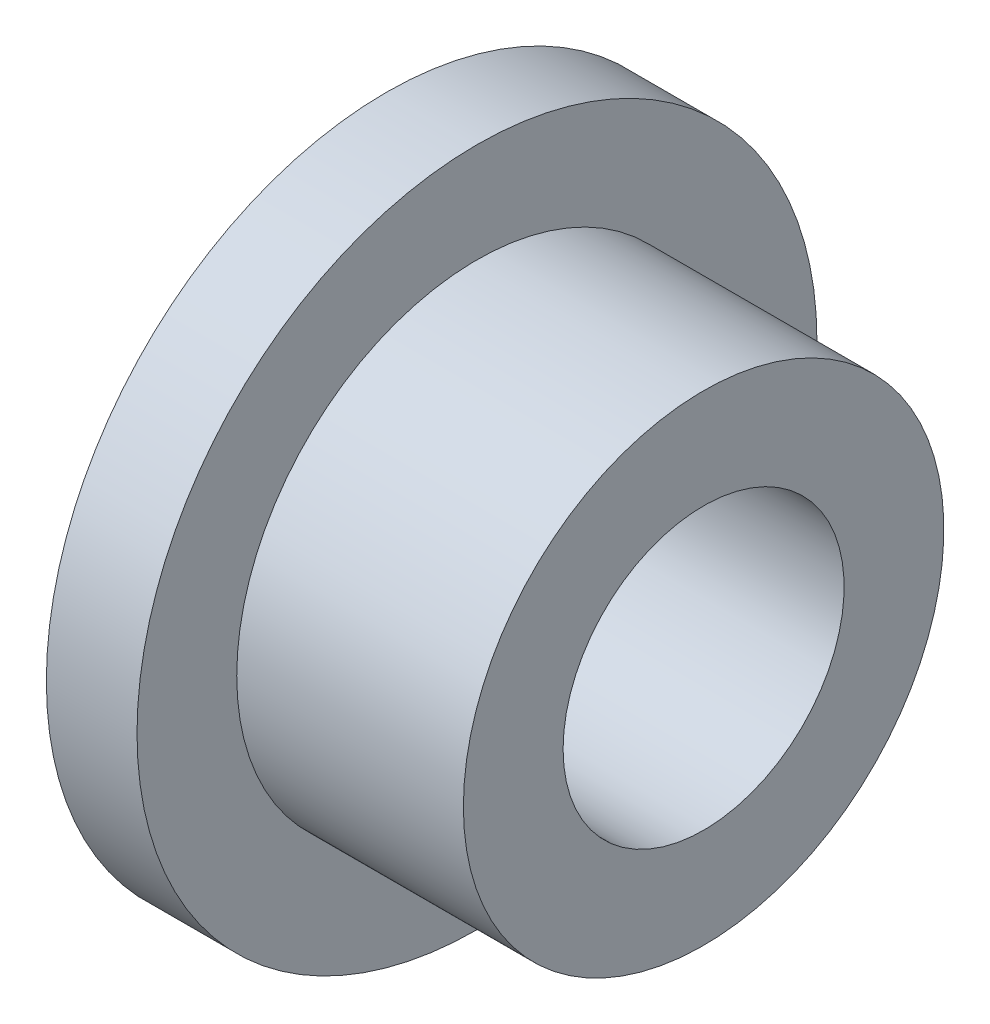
from build123d import *


with BuildPart() as part:
    # Esquisse1 → R_volution1 (revolve)
    with BuildSketch(Plane.XY, mode=Mode.PRIVATE) as r_volution1_sk:
        Polygon((0, 3.1), (0, 7.5), (2, 7.5), (2, 5.3), (7, 5.3), (7, 3.1), align=None)
    revolve(r_volution1_sk.sketch.rotate(Axis((0, 0, 0), (1, 0, 0)), 90), axis=Axis((0, 0, 0), (1, 0, 0)))


solid = part.part
